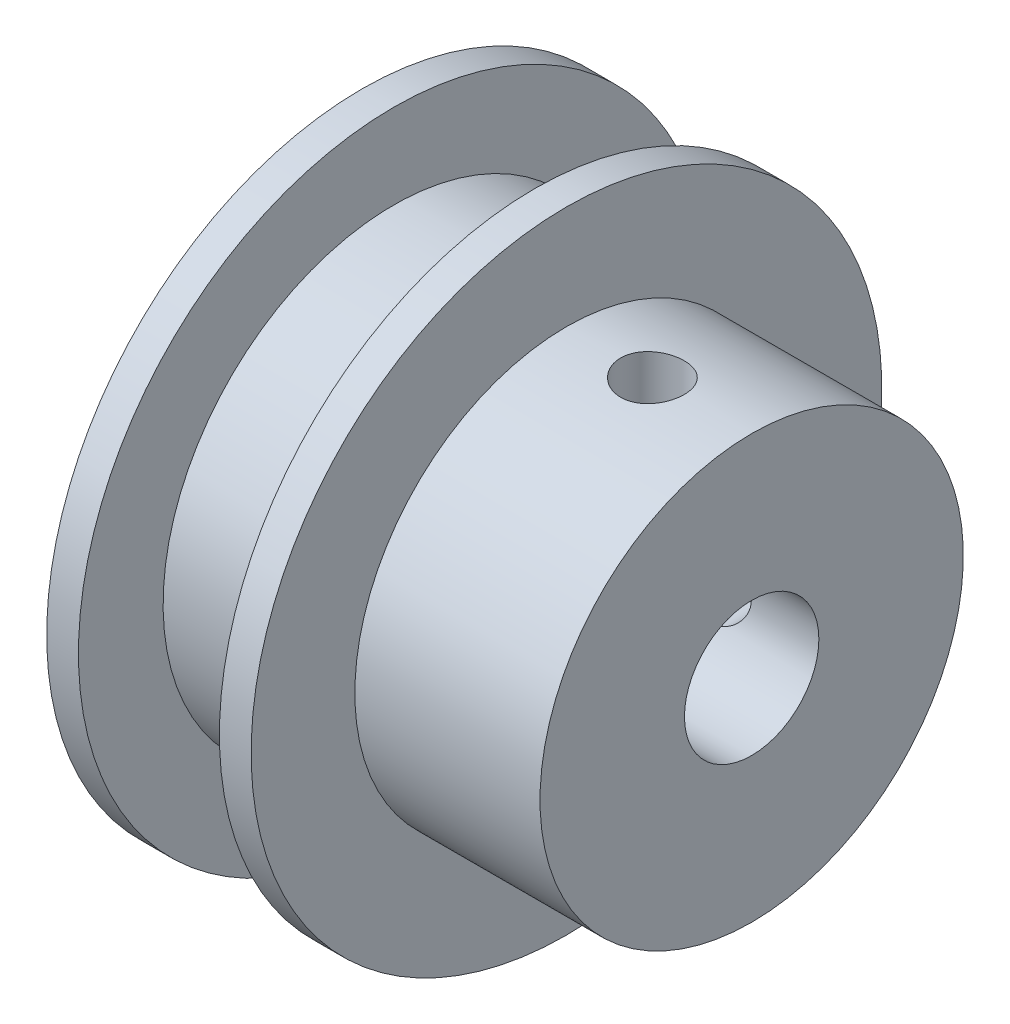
from build123d import *

# Parameters (mm, degrees)
CUT_EXTRUDE1_DEPTH      = 36.02253703
CUT_EXTRUDE1_DEPTH_BACK = 36.02253703
SKETCH4_R               = 3.175
CUT_EXTRUDE2_REACH      = 34.742
CUT_EXTRUDE2_END_RADIUS = 9.999999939
SKETCH5_R               = 1.5
CUT_EXTRUDE3_REACH      = 34.742
CUT_EXTRUDE3_END_RADIUS = 3.175
SKETCH8_R               = 1.5


with BuildPart() as part:
    # Sketch1 → Revolve1 (revolve)
    with BuildSketch(Plane.XY, mode=Mode.PRIVATE) as revolve1_sk:
        Polygon((-3.33, 0), (3.33, 0), (3.33, 4), (4.83, 4), (4.83, -0.900000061), (13.58, -0.900000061), (13.58, -10.9), (-4.83, -10.9), (-4.83, 4), (-3.33, 4), align=None)
    revolve(revolve1_sk.sketch.rotate(Axis((-4.83, -10.9, 0), (1, 0, 0)), 180), axis=Axis((-4.83, -10.9, 0), (1, 0, 0)))

    # Sketch4 → Cut-Extrude1 (cut, two sides: drawn at the far end of the back side and taken through both)
    with BuildSketch(Plane(origin=(13.58, 0, 0), x_dir=(0, 0, -1), z_dir=(1, 0, 0)).offset(-CUT_EXTRUDE1_DEPTH_BACK)):
        with Locations(Location((0, -10.9, 0), (0, 0, 90))):
            Circle(SKETCH4_R)
    extrude(amount=CUT_EXTRUDE1_DEPTH + CUT_EXTRUDE1_DEPTH_BACK, mode=Mode.SUBTRACT)

    # Cut-Extrude2: up to this cylinder (the profile starts inside it)
    cut_extrude2_end = Plane(origin=(8.89, -10.9, 0), z_dir=(-1, 0, 0)) * Cylinder(CUT_EXTRUDE2_END_RADIUS, 90.483999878, mode=Mode.PRIVATE)
    # Sketch5 → Cut-Extrude2 (cut, up to the surface)
    with BuildSketch(Plane.XY, mode=Mode.PRIVATE) as cut_extrude2_sk1:
        with Locations((8.89, -10.9)):
            Circle(SKETCH5_R)
    cut_extrude2_tool1 = extrude(cut_extrude2_sk1.sketch, amount=-CUT_EXTRUDE2_REACH, mode=Mode.PRIVATE) & cut_extrude2_end
    add(cut_extrude2_tool1.solids().sort_by_distance((8.89, -10.9, 0))[0], mode=Mode.SUBTRACT)

    # Cut-Extrude3: up to this cylinder (the profile starts outside it)
    cut_extrude3_end = Plane(origin=(8.89, -10.9, 0), z_dir=(1, 0, 0)) * Cylinder(CUT_EXTRUDE3_END_RADIUS, 76.834, mode=Mode.PRIVATE)
    # Sketch8 → Cut-Extrude3 (cut, up to the surface)
    with BuildSketch(Plane(origin=(0, 0, 0), x_dir=(1, 0, 0), z_dir=(0, 1, 0)), mode=Mode.PRIVATE) as cut_extrude3_sk1:
        with Locations(Location((8.89, 0, 0), (0, 0, 270))):
            Circle(SKETCH8_R)
    cut_extrude3_tool1 = extrude(cut_extrude3_sk1.sketch, amount=-CUT_EXTRUDE3_REACH, mode=Mode.PRIVATE) - cut_extrude3_end
    add(cut_extrude3_tool1.solids().sort_by_distance((8.89, 0, 0))[0], mode=Mode.SUBTRACT)


solid = part.part
